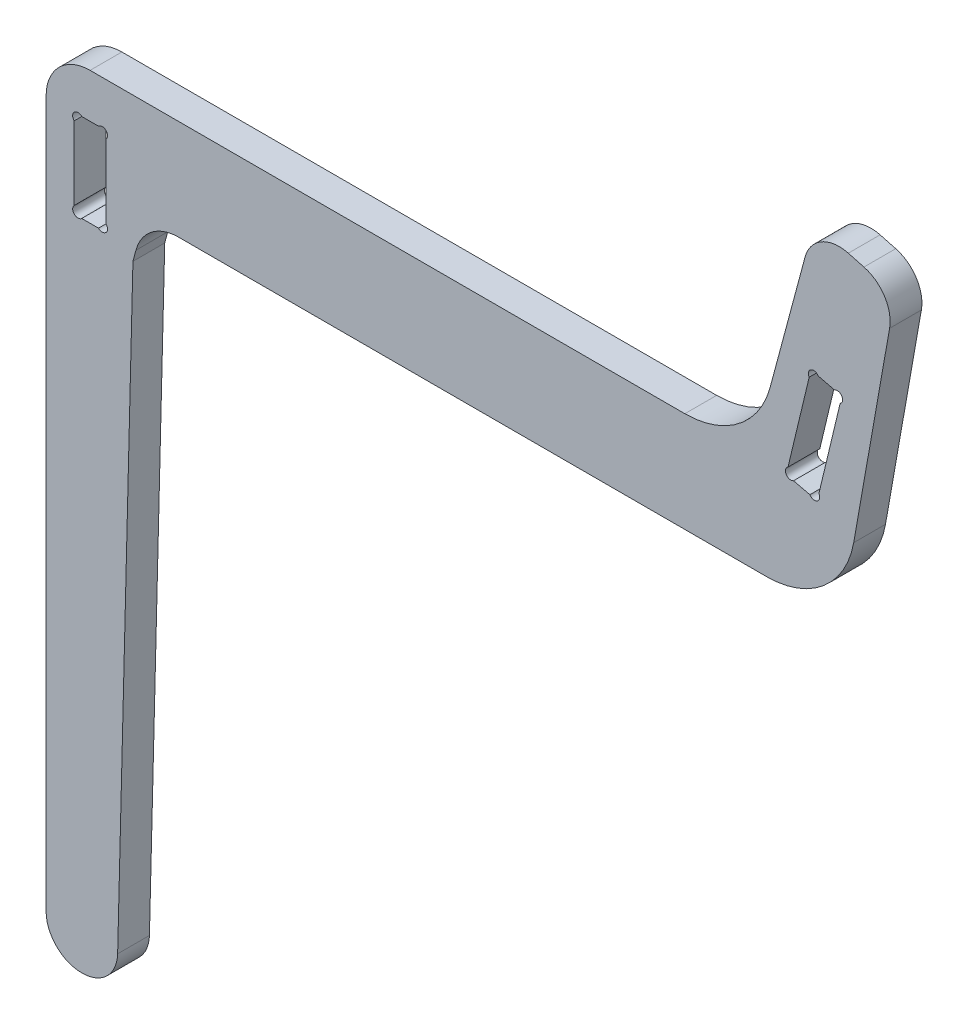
ISO-10303-21;
HEADER;
FILE_DESCRIPTION(('STEP AP214'),'2;1');
FILE_NAME('part.step','',(''),(''),'','','');
FILE_SCHEMA(('AUTOMOTIVE_DESIGN { 1 0 10303 214 1 1 1 1 }'));
ENDSEC;
DATA;
#1=APPLICATION_CONTEXT('core data for automotive mechanical design processes');
#2=APPLICATION_PROTOCOL_DEFINITION('international standard','automotive_design',2000,#1);
#3=PRODUCT_CONTEXT('',#1,'mechanical');
#4=PRODUCT('Part','Part','',(#3));
#5=PRODUCT_RELATED_PRODUCT_CATEGORY('part','',(#4));
#6=PRODUCT_DEFINITION_FORMATION('','',#4);
#7=PRODUCT_DEFINITION_CONTEXT('part definition',#1,'design');
#8=PRODUCT_DEFINITION('design','',#6,#7);
#9=PRODUCT_DEFINITION_SHAPE('','',#8);
#10=(LENGTH_UNIT() NAMED_UNIT(*) SI_UNIT(.MILLI.,.METRE.));
#11=(NAMED_UNIT(*) PLANE_ANGLE_UNIT() SI_UNIT($,.RADIAN.));
#12=(NAMED_UNIT(*) SI_UNIT($,.STERADIAN.) SOLID_ANGLE_UNIT());
#13=UNCERTAINTY_MEASURE_WITH_UNIT(LENGTH_MEASURE(1.E-05),#10,'distance_accuracy_value','');
#14=(GEOMETRIC_REPRESENTATION_CONTEXT(3) GLOBAL_UNCERTAINTY_ASSIGNED_CONTEXT((#13)) GLOBAL_UNIT_ASSIGNED_CONTEXT((#10,
#11,#12)) REPRESENTATION_CONTEXT('',''));
#15=CARTESIAN_POINT('',(0.,0.,0.));
#16=DIRECTION('',(0.,0.,1.));
#17=DIRECTION('',(1.,0.,0.));
#18=AXIS2_PLACEMENT_3D('',#15,#16,#17);
#19=CARTESIAN_POINT('',(74.1732183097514,276.818219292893,18.));
#20=DIRECTION('',(0.258819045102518,0.965925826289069,0.));
#21=DIRECTION('',(-0.965925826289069,0.258819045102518,0.));
#22=AXIS2_PLACEMENT_3D('',#19,#20,#21);
#23=PLANE('',#22);
#24=DIRECTION('',(0.965925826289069,-0.258819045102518,0.));
#25=VECTOR('',#24,1.);
#26=CARTESIAN_POINT('',(74.1732183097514,276.818219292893,0.));
#27=LINE('',#26,#25);
#28=CARTESIAN_POINT('',(454.196815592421,174.991203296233,0.));
#29=VERTEX_POINT('',#28);
#30=CARTESIAN_POINT('',(463.039607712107,172.621784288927,0.));
#31=VERTEX_POINT('',#30);
#32=EDGE_CURVE('E290',#29,#31,#27,.T.);
#33=ORIENTED_EDGE('',*,*,#32,.F.);
#34=DIRECTION('',(0.,0.,-1.));
#35=VECTOR('',#34,1.);
#36=CARTESIAN_POINT('',(454.196815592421,174.991203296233,18.));
#37=LINE('',#36,#35);
#38=CARTESIAN_POINT('',(454.196815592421,174.991203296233,18.));
#39=VERTEX_POINT('',#38);
#40=EDGE_CURVE('E359',#39,#29,#37,.T.);
#41=ORIENTED_EDGE('',*,*,#40,.F.);
#42=DIRECTION('',(0.965925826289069,-0.258819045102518,0.));
#43=VECTOR('',#42,1.);
#44=CARTESIAN_POINT('',(74.1732183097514,276.818219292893,18.));
#45=LINE('',#44,#43);
#46=CARTESIAN_POINT('',(463.039607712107,172.621784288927,18.));
#47=VERTEX_POINT('',#46);
#48=EDGE_CURVE('E473',#39,#47,#45,.T.);
#49=ORIENTED_EDGE('',*,*,#48,.T.);
#50=DIRECTION('',(0.,0.,-1.));
#51=VECTOR('',#50,1.);
#52=CARTESIAN_POINT('',(463.039607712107,172.621784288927,18.));
#53=LINE('',#52,#51);
#54=EDGE_CURVE('E334',#47,#31,#53,.T.);
#55=ORIENTED_EDGE('',*,*,#54,.T.);
#56=EDGE_LOOP('',(#33,#41,#49,#55));
#57=FACE_BOUND('',#56,.T.);
#58=ADVANCED_FACE('F35',(#57),#23,.T.);
#59=CARTESIAN_POINT('',(449.020434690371,155.672686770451,18.));
#60=DIRECTION('',(0.,0.,-1.));
#61=DIRECTION('',(-1.,0.,0.));
#62=AXIS2_PLACEMENT_3D('',#59,#60,#61);
#63=CYLINDRICAL_SURFACE('',#62,20.);
#64=CARTESIAN_POINT('',(449.020434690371,155.672686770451,0.));
#65=DIRECTION('',(0.,0.,1.));
#66=DIRECTION('',(1.,0.,0.));
#67=AXIS2_PLACEMENT_3D('',#64,#65,#66);
#68=CIRCLE('',#67,20.);
#69=CARTESIAN_POINT('',(429.701918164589,160.849067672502,0.));
#70=VERTEX_POINT('',#69);
#71=EDGE_CURVE('E293',#29,#70,#68,.T.);
#72=ORIENTED_EDGE('',*,*,#71,.T.);
#73=DIRECTION('',(0.,0.,-1.));
#74=VECTOR('',#73,1.);
#75=CARTESIAN_POINT('',(429.701918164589,160.849067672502,18.));
#76=LINE('',#75,#74);
#77=CARTESIAN_POINT('',(429.701918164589,160.849067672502,18.));
#78=VERTEX_POINT('',#77);
#79=EDGE_CURVE('E357',#78,#70,#76,.T.);
#80=ORIENTED_EDGE('',*,*,#79,.F.);
#81=CARTESIAN_POINT('',(449.020434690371,155.672686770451,18.));
#82=DIRECTION('',(0.,0.,1.));
#83=DIRECTION('',(1.,0.,0.));
#84=AXIS2_PLACEMENT_3D('',#81,#82,#83);
#85=CIRCLE('',#84,20.);
#86=EDGE_CURVE('E476',#39,#78,#85,.T.);
#87=ORIENTED_EDGE('',*,*,#86,.F.);
#88=ORIENTED_EDGE('',*,*,#40,.T.);
#89=EDGE_LOOP('',(#72,#80,#87,#88));
#90=FACE_BOUND('',#89,.T.);
#91=ADVANCED_FACE('F526',(#90),#63,.T.);
#92=CARTESIAN_POINT('',(360.705080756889,-96.6506350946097,18.));
#93=DIRECTION('',(-0.965925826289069,0.258819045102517,0.));
#94=DIRECTION('',(-0.258819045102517,-0.965925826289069,0.));
#95=AXIS2_PLACEMENT_3D('',#92,#93,#94);
#96=PLANE('',#95);
#97=DIRECTION('',(0.258819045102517,0.965925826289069,0.));
#98=VECTOR('',#97,1.);
#99=CARTESIAN_POINT('',(360.705080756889,-96.6506350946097,0.));
#100=LINE('',#99,#98);
#101=CARTESIAN_POINT('',(409.929941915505,87.0590477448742,0.));
#102=VERTEX_POINT('',#101);
#103=EDGE_CURVE('E296',#102,#70,#100,.T.);
#104=ORIENTED_EDGE('',*,*,#103,.F.);
#105=DIRECTION('',(0.,0.,-1.));
#106=VECTOR('',#105,1.);
#107=CARTESIAN_POINT('',(409.929941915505,87.0590477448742,18.));
#108=LINE('',#107,#106);
#109=CARTESIAN_POINT('',(409.929941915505,87.0590477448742,18.));
#110=VERTEX_POINT('',#109);
#111=EDGE_CURVE('E355',#110,#102,#108,.T.);
#112=ORIENTED_EDGE('',*,*,#111,.F.);
#113=DIRECTION('',(0.258819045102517,0.965925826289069,0.));
#114=VECTOR('',#113,1.);
#115=CARTESIAN_POINT('',(360.705080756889,-96.6506350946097,18.));
#116=LINE('',#115,#114);
#117=EDGE_CURVE('E478',#110,#78,#116,.T.);
#118=ORIENTED_EDGE('',*,*,#117,.T.);
#119=ORIENTED_EDGE('',*,*,#79,.T.);
#120=EDGE_LOOP('',(#104,#112,#118,#119));
#121=FACE_BOUND('',#120,.T.);
#122=ADVANCED_FACE('F529',(#121),#96,.T.);
#123=CARTESIAN_POINT('',(361.633650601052,100.,18.));
#124=DIRECTION('',(0.,0.,-1.));
#125=DIRECTION('',(-1.,0.,0.));
#126=AXIS2_PLACEMENT_3D('',#123,#124,#125);
#127=CYLINDRICAL_SURFACE('',#126,50.);
#128=CARTESIAN_POINT('',(361.633650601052,100.,0.));
#129=DIRECTION('',(0.,0.,1.));
#130=DIRECTION('',(1.,0.,0.));
#131=AXIS2_PLACEMENT_3D('',#128,#129,#130);
#132=CIRCLE('',#131,50.);
#133=CARTESIAN_POINT('',(361.633650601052,50.0000000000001,0.));
#134=VERTEX_POINT('',#133);
#135=EDGE_CURVE('E299',#102,#134,#132,.F.);
#136=ORIENTED_EDGE('',*,*,#135,.T.);
#137=DIRECTION('',(0.,0.,-1.));
#138=VECTOR('',#137,1.);
#139=CARTESIAN_POINT('',(361.633650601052,50.0000000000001,18.));
#140=LINE('',#139,#138);
#141=CARTESIAN_POINT('',(361.633650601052,50.0000000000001,18.));
#142=VERTEX_POINT('',#141);
#143=EDGE_CURVE('E353',#142,#134,#140,.T.);
#144=ORIENTED_EDGE('',*,*,#143,.F.);
#145=CARTESIAN_POINT('',(361.633650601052,100.,18.));
#146=DIRECTION('',(0.,0.,1.));
#147=DIRECTION('',(1.,0.,0.));
#148=AXIS2_PLACEMENT_3D('',#145,#146,#147);
#149=CIRCLE('',#148,50.);
#150=EDGE_CURVE('E481',#110,#142,#149,.F.);
#151=ORIENTED_EDGE('',*,*,#150,.F.);
#152=ORIENTED_EDGE('',*,*,#111,.T.);
#153=EDGE_LOOP('',(#136,#144,#151,#152));
#154=FACE_BOUND('',#153,.T.);
#155=ADVANCED_FACE('F535',(#154),#127,.F.);
#156=CARTESIAN_POINT('',(0.,50.,18.));
#157=DIRECTION('',(0.,1.,0.));
#158=DIRECTION('',(-1.,0.,0.));
#159=AXIS2_PLACEMENT_3D('',#156,#157,#158);
#160=PLANE('',#159);
#161=DIRECTION('',(1.,0.,0.));
#162=VECTOR('',#161,1.);
#163=CARTESIAN_POINT('',(0.,50.,0.));
#164=LINE('',#163,#162);
#165=CARTESIAN_POINT('',(24.9000000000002,50.,0.));
#166=VERTEX_POINT('',#165);
#167=EDGE_CURVE('E302',#166,#134,#164,.T.);
#168=ORIENTED_EDGE('',*,*,#167,.F.);
#169=DIRECTION('',(0.,0.,-1.));
#170=VECTOR('',#169,1.);
#171=CARTESIAN_POINT('',(24.9000000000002,50.,18.));
#172=LINE('',#171,#170);
#173=CARTESIAN_POINT('',(24.9000000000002,50.,18.));
#174=VERTEX_POINT('',#173);
#175=EDGE_CURVE('E351',#174,#166,#172,.T.);
#176=ORIENTED_EDGE('',*,*,#175,.F.);
#177=DIRECTION('',(1.,0.,0.));
#178=VECTOR('',#177,1.);
#179=CARTESIAN_POINT('',(0.,50.,18.));
#180=LINE('',#179,#178);
#181=EDGE_CURVE('E483',#174,#142,#180,.T.);
#182=ORIENTED_EDGE('',*,*,#181,.T.);
#183=ORIENTED_EDGE('',*,*,#143,.T.);
#184=EDGE_LOOP('',(#168,#176,#182,#183));
#185=FACE_BOUND('',#184,.T.);
#186=ADVANCED_FACE('F539',(#185),#160,.T.);
#187=CARTESIAN_POINT('',(24.9,25.1,18.));
#188=DIRECTION('',(0.,0.,-1.));
#189=DIRECTION('',(-1.,0.,0.));
#190=AXIS2_PLACEMENT_3D('',#187,#188,#189);
#191=CYLINDRICAL_SURFACE('',#190,24.9);
#192=CARTESIAN_POINT('',(24.9,25.1,0.));
#193=DIRECTION('',(0.,0.,1.));
#194=DIRECTION('',(1.,0.,0.));
#195=AXIS2_PLACEMENT_3D('',#192,#193,#194);
#196=CIRCLE('',#195,24.9);
#197=CARTESIAN_POINT('',(0.,25.0999999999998,0.));
#198=VERTEX_POINT('',#197);
#199=EDGE_CURVE('E305',#198,#166,#196,.F.);
#200=ORIENTED_EDGE('',*,*,#199,.F.);
#201=DIRECTION('',(0.,0.,-1.));
#202=VECTOR('',#201,1.);
#203=CARTESIAN_POINT('',(0.,25.0999999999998,18.));
#204=LINE('',#203,#202);
#205=CARTESIAN_POINT('',(0.,25.0999999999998,18.));
#206=VERTEX_POINT('',#205);
#207=EDGE_CURVE('E348',#206,#198,#204,.T.);
#208=ORIENTED_EDGE('',*,*,#207,.F.);
#209=CARTESIAN_POINT('',(24.9,25.1,18.));
#210=DIRECTION('',(0.,0.,1.));
#211=DIRECTION('',(1.,0.,0.));
#212=AXIS2_PLACEMENT_3D('',#209,#210,#211);
#213=CIRCLE('',#212,24.9);
#214=EDGE_CURVE('E486',#206,#174,#213,.F.);
#215=ORIENTED_EDGE('',*,*,#214,.T.);
#216=ORIENTED_EDGE('',*,*,#175,.T.);
#217=EDGE_LOOP('',(#200,#208,#215,#216));
#218=FACE_BOUND('',#217,.T.);
#219=ADVANCED_FACE('F542',(#218),#191,.T.);
#220=CARTESIAN_POINT('',(0.,0.,18.));
#221=DIRECTION('',(-1.,0.,0.));
#222=DIRECTION('',(0.,0.,1.));
#223=AXIS2_PLACEMENT_3D('',#220,#221,#222);
#224=PLANE('',#223);
#225=DIRECTION('',(0.,1.,0.));
#226=VECTOR('',#225,1.);
#227=CARTESIAN_POINT('',(0.,0.,0.));
#228=LINE('',#227,#226);
#229=CARTESIAN_POINT('',(0.,-374.9,0.));
#230=VERTEX_POINT('',#229);
#231=EDGE_CURVE('E308',#230,#198,#228,.T.);
#232=ORIENTED_EDGE('',*,*,#231,.F.);
#233=DIRECTION('',(0.,0.,-1.));
#234=VECTOR('',#233,1.);
#235=CARTESIAN_POINT('',(0.,-374.9,18.));
#236=LINE('',#235,#234);
#237=CARTESIAN_POINT('',(0.,-374.9,18.));
#238=VERTEX_POINT('',#237);
#239=EDGE_CURVE('E370',#230,#238,#236,.F.);
#240=ORIENTED_EDGE('',*,*,#239,.T.);
#241=DIRECTION('',(0.,1.,0.));
#242=VECTOR('',#241,1.);
#243=CARTESIAN_POINT('',(0.,0.,18.));
#244=LINE('',#243,#242);
#245=EDGE_CURVE('E489',#238,#206,#244,.T.);
#246=ORIENTED_EDGE('',*,*,#245,.T.);
#247=ORIENTED_EDGE('',*,*,#207,.T.);
#248=EDGE_LOOP('',(#232,#240,#246,#247));
#249=FACE_BOUND('',#248,.T.);
#250=ADVANCED_FACE('F583',(#249),#224,.T.);
#251=CARTESIAN_POINT('',(0.,-394.9,18.));
#252=DIRECTION('',(0.,1.,0.));
#253=DIRECTION('',(0.,0.,1.));
#254=AXIS2_PLACEMENT_3D('',#251,#252,#253);
#255=PLANE('',#254);
#256=DIRECTION('',(1.,0.,0.));
#257=VECTOR('',#256,1.);
#258=CARTESIAN_POINT('',(0.,-394.9,18.));
#259=LINE('',#258,#257);
#260=CARTESIAN_POINT('',(20.,-394.9,18.));
#261=VERTEX_POINT('',#260);
#262=CARTESIAN_POINT('',(20.4974080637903,-394.9,18.));
#263=VERTEX_POINT('',#262);
#264=EDGE_CURVE('E491',#261,#263,#259,.T.);
#265=ORIENTED_EDGE('',*,*,#264,.F.);
#266=DIRECTION('',(0.,0.,-1.));
#267=VECTOR('',#266,1.);
#268=CARTESIAN_POINT('',(20.,-394.9,0.));
#269=LINE('',#268,#267);
#270=CARTESIAN_POINT('',(20.,-394.9,0.));
#271=VERTEX_POINT('',#270);
#272=EDGE_CURVE('E363',#261,#271,#269,.T.);
#273=ORIENTED_EDGE('',*,*,#272,.T.);
#274=DIRECTION('',(1.,0.,0.));
#275=VECTOR('',#274,1.);
#276=CARTESIAN_POINT('',(0.,-394.9,0.));
#277=LINE('',#276,#275);
#278=CARTESIAN_POINT('',(20.4974080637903,-394.9,0.));
#279=VERTEX_POINT('',#278);
#280=EDGE_CURVE('E310',#271,#279,#277,.T.);
#281=ORIENTED_EDGE('',*,*,#280,.T.);
#282=DIRECTION('',(0.,0.,-1.));
#283=VECTOR('',#282,1.);
#284=CARTESIAN_POINT('',(20.4974080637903,-394.9,18.));
#285=LINE('',#284,#283);
#286=EDGE_CURVE('E361',#279,#263,#285,.F.);
#287=ORIENTED_EDGE('',*,*,#286,.T.);
#288=EDGE_LOOP('',(#265,#273,#281,#287));
#289=FACE_BOUND('',#288,.T.);
#290=ADVANCED_FACE('F553',(#289),#255,.F.);
#291=CARTESIAN_POINT('',(49.914900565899,-1.25723452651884,18.));
#292=DIRECTION('',(0.999682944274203,-0.0251795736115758,0.));
#293=DIRECTION('',(0.0251795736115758,0.999682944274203,0.));
#294=AXIS2_PLACEMENT_3D('',#291,#292,#293);
#295=PLANE('',#294);
#296=DIRECTION('',(-0.0251795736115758,-0.999682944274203,0.));
#297=VECTOR('',#296,1.);
#298=CARTESIAN_POINT('',(49.914900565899,-1.25723452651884,18.));
#299=LINE('',#298,#297);
#300=CARTESIAN_POINT('',(49.1520859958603,-31.5426050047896,18.));
#301=VERTEX_POINT('',#300);
#302=CARTESIAN_POINT('',(40.4910669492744,-375.403591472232,18.));
#303=VERTEX_POINT('',#302);
#304=EDGE_CURVE('E494',#301,#303,#299,.T.);
#305=ORIENTED_EDGE('',*,*,#304,.T.);
#306=DIRECTION('',(0.,0.,-1.));
#307=VECTOR('',#306,1.);
#308=CARTESIAN_POINT('',(40.4910669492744,-375.403591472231,0.));
#309=LINE('',#308,#307);
#310=CARTESIAN_POINT('',(40.4910669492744,-375.403591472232,0.));
#311=VERTEX_POINT('',#310);
#312=EDGE_CURVE('E376',#303,#311,#309,.T.);
#313=ORIENTED_EDGE('',*,*,#312,.T.);
#314=DIRECTION('',(-0.0251795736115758,-0.999682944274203,0.));
#315=VECTOR('',#314,1.);
#316=CARTESIAN_POINT('',(49.914900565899,-1.25723452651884,0.));
#317=LINE('',#316,#315);
#318=CARTESIAN_POINT('',(49.1520859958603,-31.5426050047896,0.));
#319=VERTEX_POINT('',#318);
#320=EDGE_CURVE('E313',#319,#311,#317,.T.);
#321=ORIENTED_EDGE('',*,*,#320,.F.);
#322=DIRECTION('',(0.,0.,-1.));
#323=VECTOR('',#322,1.);
#324=CARTESIAN_POINT('',(49.1520859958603,-31.5426050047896,18.));
#325=LINE('',#324,#323);
#326=EDGE_CURVE('E346',#301,#319,#325,.T.);
#327=ORIENTED_EDGE('',*,*,#326,.F.);
#328=EDGE_LOOP('',(#305,#313,#321,#327));
#329=FACE_BOUND('',#328,.T.);
#330=ADVANCED_FACE('F562',(#329),#295,.T.);
#331=CARTESIAN_POINT('',(53.744944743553,-14.3961505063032,18.));
#332=DIRECTION('',(-0.965947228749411,0.258739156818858,0.));
#333=DIRECTION('',(-0.258739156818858,-0.965947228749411,0.));
#334=AXIS2_PLACEMENT_3D('',#331,#332,#333);
#335=PLANE('',#334);
#336=DIRECTION('',(0.258739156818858,0.965947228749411,0.));
#337=VECTOR('',#336,1.);
#338=CARTESIAN_POINT('',(53.744944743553,-14.3961505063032,0.));
#339=LINE('',#338,#337);
#340=CARTESIAN_POINT('',(50.8479140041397,-25.2115943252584,0.));
#341=VERTEX_POINT('',#340);
#342=EDGE_CURVE('E316',#319,#341,#339,.T.);
#343=ORIENTED_EDGE('',*,*,#342,.T.);
#344=DIRECTION('',(0.,0.,-1.));
#345=VECTOR('',#344,1.);
#346=CARTESIAN_POINT('',(50.8479140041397,-25.2115943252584,18.));
#347=LINE('',#346,#345);
#348=CARTESIAN_POINT('',(50.8479140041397,-25.2115943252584,18.));
#349=VERTEX_POINT('',#348);
#350=EDGE_CURVE('E344',#349,#341,#347,.T.);
#351=ORIENTED_EDGE('',*,*,#350,.F.);
#352=DIRECTION('',(0.258739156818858,0.965947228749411,0.));
#353=VECTOR('',#352,1.);
#354=CARTESIAN_POINT('',(53.744944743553,-14.3961505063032,18.));
#355=LINE('',#354,#353);
#356=EDGE_CURVE('E497',#301,#349,#355,.T.);
#357=ORIENTED_EDGE('',*,*,#356,.F.);
#358=ORIENTED_EDGE('',*,*,#326,.T.);
#359=EDGE_LOOP('',(#343,#351,#357,#358));
#360=FACE_BOUND('',#359,.T.);
#361=ADVANCED_FACE('F568',(#360),#335,.F.);
#362=CARTESIAN_POINT('',(74.9,-31.654199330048,18.));
#363=DIRECTION('',(0.,0.,-1.));
#364=DIRECTION('',(-1.,0.,0.));
#365=AXIS2_PLACEMENT_3D('',#362,#363,#364);
#366=CYLINDRICAL_SURFACE('',#365,24.9);
#367=CARTESIAN_POINT('',(74.9,-31.654199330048,0.));
#368=DIRECTION('',(0.,0.,1.));
#369=DIRECTION('',(1.,0.,0.));
#370=AXIS2_PLACEMENT_3D('',#367,#368,#369);
#371=CIRCLE('',#370,24.9);
#372=CARTESIAN_POINT('',(74.9,-6.75419933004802,0.));
#373=VERTEX_POINT('',#372);
#374=EDGE_CURVE('E319',#373,#341,#371,.T.);
#375=ORIENTED_EDGE('',*,*,#374,.F.);
#376=DIRECTION('',(0.,0.,-1.));
#377=VECTOR('',#376,1.);
#378=CARTESIAN_POINT('',(74.9,-6.75419933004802,18.));
#379=LINE('',#378,#377);
#380=CARTESIAN_POINT('',(74.9,-6.75419933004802,18.));
#381=VERTEX_POINT('',#380);
#382=EDGE_CURVE('E342',#381,#373,#379,.T.);
#383=ORIENTED_EDGE('',*,*,#382,.F.);
#384=CARTESIAN_POINT('',(74.9,-31.654199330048,18.));
#385=DIRECTION('',(0.,0.,1.));
#386=DIRECTION('',(1.,0.,0.));
#387=AXIS2_PLACEMENT_3D('',#384,#385,#386);
#388=CIRCLE('',#387,24.9);
#389=EDGE_CURVE('E499',#381,#349,#388,.T.);
#390=ORIENTED_EDGE('',*,*,#389,.T.);
#391=ORIENTED_EDGE('',*,*,#350,.T.);
#392=EDGE_LOOP('',(#375,#383,#390,#391));
#393=FACE_BOUND('',#392,.T.);
#394=ADVANCED_FACE('F571',(#393),#366,.F.);
#395=CARTESIAN_POINT('',(0.,-6.75419933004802,18.));
#396=DIRECTION('',(0.,1.,0.));
#397=DIRECTION('',(0.,0.,1.));
#398=AXIS2_PLACEMENT_3D('',#395,#396,#397);
#399=PLANE('',#398);
#400=DIRECTION('',(1.,0.,0.));
#401=VECTOR('',#400,1.);
#402=CARTESIAN_POINT('',(0.,-6.75419933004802,0.));
#403=LINE('',#402,#401);
#404=CARTESIAN_POINT('',(407.99432757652,-6.75419933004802,0.));
#405=VERTEX_POINT('',#404);
#406=EDGE_CURVE('E322',#373,#405,#403,.T.);
#407=ORIENTED_EDGE('',*,*,#406,.T.);
#408=DIRECTION('',(0.,0.,-1.));
#409=VECTOR('',#408,1.);
#410=CARTESIAN_POINT('',(407.99432757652,-6.75419933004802,18.));
#411=LINE('',#410,#409);
#412=CARTESIAN_POINT('',(407.99432757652,-6.75419933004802,18.));
#413=VERTEX_POINT('',#412);
#414=EDGE_CURVE('E340',#413,#405,#411,.T.);
#415=ORIENTED_EDGE('',*,*,#414,.F.);
#416=DIRECTION('',(1.,0.,0.));
#417=VECTOR('',#416,1.);
#418=CARTESIAN_POINT('',(0.,-6.75419933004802,18.));
#419=LINE('',#418,#417);
#420=EDGE_CURVE('E502',#381,#413,#419,.T.);
#421=ORIENTED_EDGE('',*,*,#420,.F.);
#422=ORIENTED_EDGE('',*,*,#382,.T.);
#423=EDGE_LOOP('',(#407,#415,#421,#422));
#424=FACE_BOUND('',#423,.T.);
#425=ADVANCED_FACE('F576',(#424),#399,.F.);
#426=CARTESIAN_POINT('',(407.99432757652,43.245800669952,18.));
#427=DIRECTION('',(0.,0.,-1.));
#428=DIRECTION('',(-1.,0.,0.));
#429=AXIS2_PLACEMENT_3D('',#426,#427,#428);
#430=CYLINDRICAL_SURFACE('',#429,50.);
#431=CARTESIAN_POINT('',(407.99432757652,43.245800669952,0.));
#432=DIRECTION('',(0.,0.,1.));
#433=DIRECTION('',(1.,0.,0.));
#434=AXIS2_PLACEMENT_3D('',#431,#432,#433);
#435=CIRCLE('',#434,50.);
#436=CARTESIAN_POINT('',(457.234715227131,34.5633917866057,0.));
#437=VERTEX_POINT('',#436);
#438=EDGE_CURVE('E325',#437,#405,#435,.F.);
#439=ORIENTED_EDGE('',*,*,#438,.F.);
#440=DIRECTION('',(0.,0.,-1.));
#441=VECTOR('',#440,1.);
#442=CARTESIAN_POINT('',(457.234715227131,34.5633917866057,18.));
#443=LINE('',#442,#441);
#444=CARTESIAN_POINT('',(457.234715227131,34.5633917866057,18.));
#445=VERTEX_POINT('',#444);
#446=EDGE_CURVE('E338',#445,#437,#443,.T.);
#447=ORIENTED_EDGE('',*,*,#446,.F.);
#448=CARTESIAN_POINT('',(407.99432757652,43.245800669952,18.));
#449=DIRECTION('',(0.,0.,1.));
#450=DIRECTION('',(1.,0.,0.));
#451=AXIS2_PLACEMENT_3D('',#448,#449,#450);
#452=CIRCLE('',#451,50.);
#453=EDGE_CURVE('E504',#445,#413,#452,.F.);
#454=ORIENTED_EDGE('',*,*,#453,.T.);
#455=ORIENTED_EDGE('',*,*,#414,.T.);
#456=EDGE_LOOP('',(#439,#447,#454,#455));
#457=FACE_BOUND('',#456,.T.);
#458=ADVANCED_FACE('F579',(#457),#430,.T.);
#459=CARTESIAN_POINT('',(437.536713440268,-77.1495276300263,18.));
#460=DIRECTION('',(-0.984807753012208,0.173648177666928,0.));
#461=DIRECTION('',(-0.173648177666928,-0.984807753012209,0.));
#462=AXIS2_PLACEMENT_3D('',#459,#460,#461);
#463=PLANE('',#462);
#464=DIRECTION('',(0.173648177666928,0.984807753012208,0.));
#465=VECTOR('',#464,1.);
#466=CARTESIAN_POINT('',(437.536713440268,-77.1495276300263,0.));
#467=LINE('',#466,#465);
#468=CARTESIAN_POINT('',(477.559381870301,149.830304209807,0.));
#469=VERTEX_POINT('',#468);
#470=EDGE_CURVE('E328',#437,#469,#467,.T.);
#471=ORIENTED_EDGE('',*,*,#470,.T.);
#472=DIRECTION('',(0.,0.,-1.));
#473=VECTOR('',#472,1.);
#474=CARTESIAN_POINT('',(477.559381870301,149.830304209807,18.));
#475=LINE('',#474,#473);
#476=CARTESIAN_POINT('',(477.559381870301,149.830304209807,18.));
#477=VERTEX_POINT('',#476);
#478=EDGE_CURVE('E336',#477,#469,#475,.T.);
#479=ORIENTED_EDGE('',*,*,#478,.F.);
#480=DIRECTION('',(0.173648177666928,0.984807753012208,0.));
#481=VECTOR('',#480,1.);
#482=CARTESIAN_POINT('',(437.536713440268,-77.1495276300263,18.));
#483=LINE('',#482,#481);
#484=EDGE_CURVE('E506',#445,#477,#483,.T.);
#485=ORIENTED_EDGE('',*,*,#484,.F.);
#486=ORIENTED_EDGE('',*,*,#446,.T.);
#487=EDGE_LOOP('',(#471,#479,#485,#486));
#488=FACE_BOUND('',#487,.T.);
#489=ADVANCED_FACE('F582',(#488),#463,.F.);
#490=CARTESIAN_POINT('',(47.7796437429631,199.504277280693,18.));
#491=DIRECTION('',(0.232905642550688,0.97249933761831,0.));
#492=DIRECTION('',(-0.97249933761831,0.232905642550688,0.));
#493=AXIS2_PLACEMENT_3D('',#490,#491,#492);
#494=PLANE('',#493);
#495=DIRECTION('',(0.97249933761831,-0.232905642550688,0.));
#496=VECTOR('',#495,1.);
#497=CARTESIAN_POINT('',(47.7796437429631,199.504277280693,0.));
#498=LINE('',#497,#496);
#499=CARTESIAN_POINT('',(437.152341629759,106.252698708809,0.));
#500=VERTEX_POINT('',#499);
#501=CARTESIAN_POINT('',(446.405399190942,104.036667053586,0.));
#502=VERTEX_POINT('',#501);
#503=EDGE_CURVE('E265',#500,#502,#498,.T.);
#504=ORIENTED_EDGE('',*,*,#503,.T.);
#505=DIRECTION('',(0.,0.,1.));
#506=VECTOR('',#505,1.);
#507=CARTESIAN_POINT('',(446.405399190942,104.036667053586,0.));
#508=LINE('',#507,#506);
#509=CARTESIAN_POINT('',(446.405399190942,104.036667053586,18.));
#510=VERTEX_POINT('',#509);
#511=EDGE_CURVE('E401',#502,#510,#508,.T.);
#512=ORIENTED_EDGE('',*,*,#511,.T.);
#513=DIRECTION('',(0.97249933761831,-0.232905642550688,0.));
#514=VECTOR('',#513,1.);
#515=CARTESIAN_POINT('',(47.7796437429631,199.504277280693,18.));
#516=LINE('',#515,#514);
#517=CARTESIAN_POINT('',(437.152341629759,106.252698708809,18.));
#518=VERTEX_POINT('',#517);
#519=EDGE_CURVE('E267',#518,#510,#516,.T.);
#520=ORIENTED_EDGE('',*,*,#519,.F.);
#521=DIRECTION('',(0.,0.,1.));
#522=VECTOR('',#521,1.);
#523=CARTESIAN_POINT('',(437.152341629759,106.252698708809,0.));
#524=LINE('',#523,#522);
#525=EDGE_CURVE('E251',#518,#500,#524,.F.);
#526=ORIENTED_EDGE('',*,*,#525,.T.);
#527=EDGE_LOOP('',(#504,#512,#520,#526));
#528=FACE_BOUND('',#527,.T.);
#529=ADVANCED_FACE('F263',(#528),#494,.F.);
#530=CARTESIAN_POINT('',(402.751720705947,-96.4557451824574,18.));
#531=DIRECTION('',(0.972499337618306,-0.232905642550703,0.));
#532=DIRECTION('',(0.232905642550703,0.972499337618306,0.));
#533=AXIS2_PLACEMENT_3D('',#530,#531,#532);
#534=PLANE('',#533);
#535=DIRECTION('',(-0.232905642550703,-0.972499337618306,0.));
#536=VECTOR('',#535,1.);
#537=CARTESIAN_POINT('',(402.751720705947,-96.4557451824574,0.));
#538=LINE('',#537,#536);
#539=CARTESIAN_POINT('',(449.543229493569,98.9225668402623,0.));
#540=VERTEX_POINT('',#539);
#541=CARTESIAN_POINT('',(437.545160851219,48.8245370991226,0.));
#542=VERTEX_POINT('',#541);
#543=EDGE_CURVE('E274',#540,#542,#538,.T.);
#544=ORIENTED_EDGE('',*,*,#543,.T.);
#545=DIRECTION('',(0.,0.,1.));
#546=VECTOR('',#545,1.);
#547=CARTESIAN_POINT('',(437.545160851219,48.8245370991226,0.));
#548=LINE('',#547,#546);
#549=CARTESIAN_POINT('',(437.545160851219,48.8245370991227,18.));
#550=VERTEX_POINT('',#549);
#551=EDGE_CURVE('E50',#542,#550,#548,.T.);
#552=ORIENTED_EDGE('',*,*,#551,.T.);
#553=DIRECTION('',(-0.232905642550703,-0.972499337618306,0.));
#554=VECTOR('',#553,1.);
#555=CARTESIAN_POINT('',(402.751720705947,-96.4557451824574,18.));
#556=LINE('',#555,#554);
#557=CARTESIAN_POINT('',(449.543229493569,98.9225668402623,18.));
#558=VERTEX_POINT('',#557);
#559=EDGE_CURVE('E399',#558,#550,#556,.T.);
#560=ORIENTED_EDGE('',*,*,#559,.F.);
#561=DIRECTION('',(0.,0.,1.));
#562=VECTOR('',#561,1.);
#563=CARTESIAN_POINT('',(449.543229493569,98.9225668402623,0.));
#564=LINE('',#563,#562);
#565=EDGE_CURVE('E268',#558,#540,#564,.F.);
#566=ORIENTED_EDGE('',*,*,#565,.T.);
#567=EDGE_LOOP('',(#544,#552,#560,#566));
#568=FACE_BOUND('',#567,.T.);
#569=ADVANCED_FACE('F395',(#568),#534,.F.);
#570=CARTESIAN_POINT('',(33.8053051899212,141.154317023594,18.));
#571=DIRECTION('',(0.232905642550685,0.97249933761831,0.));
#572=DIRECTION('',(-0.972499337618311,0.232905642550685,0.));
#573=AXIS2_PLACEMENT_3D('',#570,#571,#572);
#574=PLANE('',#573);
#575=DIRECTION('',(0.,0.,1.));
#576=VECTOR('',#575,1.);
#577=CARTESIAN_POINT('',(423.178003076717,47.902738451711,0.));
#578=LINE('',#577,#576);
#579=CARTESIAN_POINT('',(423.178003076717,47.902738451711,18.));
#580=VERTEX_POINT('',#579);
#581=CARTESIAN_POINT('',(423.178003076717,47.902738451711,0.));
#582=VERTEX_POINT('',#581);
#583=EDGE_CURVE('E412',#580,#582,#578,.F.);
#584=ORIENTED_EDGE('',*,*,#583,.F.);
#585=DIRECTION('',(0.972499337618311,-0.232905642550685,0.));
#586=VECTOR('',#585,1.);
#587=CARTESIAN_POINT('',(33.8053051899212,141.154317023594,18.));
#588=LINE('',#587,#586);
#589=CARTESIAN_POINT('',(432.4310606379,45.6867067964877,18.));
#590=VERTEX_POINT('',#589);
#591=EDGE_CURVE('E467',#580,#590,#588,.T.);
#592=ORIENTED_EDGE('',*,*,#591,.T.);
#593=DIRECTION('',(0.,0.,1.));
#594=VECTOR('',#593,1.);
#595=CARTESIAN_POINT('',(432.4310606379,45.6867067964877,0.));
#596=LINE('',#595,#594);
#597=CARTESIAN_POINT('',(432.4310606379,45.6867067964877,0.));
#598=VERTEX_POINT('',#597);
#599=EDGE_CURVE('E403',#598,#590,#596,.T.);
#600=ORIENTED_EDGE('',*,*,#599,.F.);
#601=DIRECTION('',(0.972499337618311,-0.232905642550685,0.));
#602=VECTOR('',#601,1.);
#603=CARTESIAN_POINT('',(33.8053051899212,141.154317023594,0.));
#604=LINE('',#603,#602);
#605=EDGE_CURVE('E278',#582,#598,#604,.T.);
#606=ORIENTED_EDGE('',*,*,#605,.F.);
#607=EDGE_LOOP('',(#584,#592,#600,#606));
#608=FACE_BOUND('',#607,.T.);
#609=ADVANCED_FACE('F603',(#608),#574,.T.);
#610=CARTESIAN_POINT('',(385.246732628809,-92.2634436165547,18.));
#611=DIRECTION('',(0.972499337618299,-0.232905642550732,0.));
#612=DIRECTION('',(0.232905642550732,0.972499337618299,0.));
#613=AXIS2_PLACEMENT_3D('',#610,#611,#612);
#614=PLANE('',#613);
#615=DIRECTION('',(0.,0.,1.));
#616=VECTOR('',#615,1.);
#617=CARTESIAN_POINT('',(420.040172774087,53.0168386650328,0.));
#618=LINE('',#617,#616);
#619=CARTESIAN_POINT('',(420.040172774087,53.0168386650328,0.));
#620=VERTEX_POINT('',#619);
#621=CARTESIAN_POINT('',(420.040172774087,53.0168386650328,18.));
#622=VERTEX_POINT('',#621);
#623=EDGE_CURVE('E409',#620,#622,#618,.T.);
#624=ORIENTED_EDGE('',*,*,#623,.F.);
#625=DIRECTION('',(-0.232905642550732,-0.972499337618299,0.));
#626=VECTOR('',#625,1.);
#627=CARTESIAN_POINT('',(385.246732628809,-92.2634436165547,0.));
#628=LINE('',#627,#626);
#629=CARTESIAN_POINT('',(432.038241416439,103.114868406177,0.));
#630=VERTEX_POINT('',#629);
#631=EDGE_CURVE('E288',#630,#620,#628,.T.);
#632=ORIENTED_EDGE('',*,*,#631,.F.);
#633=DIRECTION('',(0.,0.,1.));
#634=VECTOR('',#633,1.);
#635=CARTESIAN_POINT('',(432.038241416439,103.114868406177,0.));
#636=LINE('',#635,#634);
#637=CARTESIAN_POINT('',(432.038241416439,103.114868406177,18.));
#638=VERTEX_POINT('',#637);
#639=EDGE_CURVE('E254',#638,#630,#636,.F.);
#640=ORIENTED_EDGE('',*,*,#639,.F.);
#641=DIRECTION('',(-0.232905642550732,-0.972499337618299,0.));
#642=VECTOR('',#641,1.);
#643=CARTESIAN_POINT('',(385.246732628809,-92.2634436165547,18.));
#644=LINE('',#643,#642);
#645=EDGE_CURVE('E470',#638,#622,#644,.T.);
#646=ORIENTED_EDGE('',*,*,#645,.T.);
#647=EDGE_LOOP('',(#624,#632,#640,#646));
#648=FACE_BOUND('',#647,.T.);
#649=ADVANCED_FACE('F600',(#648),#614,.T.);
#650=CARTESIAN_POINT('',(457.863226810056,153.303267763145,18.));
#651=DIRECTION('',(0.,0.,-1.));
#652=DIRECTION('',(-1.,0.,0.));
#653=AXIS2_PLACEMENT_3D('',#650,#651,#652);
#654=CYLINDRICAL_SURFACE('',#653,20.);
#655=CARTESIAN_POINT('',(457.863226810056,153.303267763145,0.));
#656=DIRECTION('',(0.,0.,1.));
#657=DIRECTION('',(1.,0.,0.));
#658=AXIS2_PLACEMENT_3D('',#655,#656,#657);
#659=CIRCLE('',#658,20.);
#660=EDGE_CURVE('E331',#31,#469,#659,.F.);
#661=ORIENTED_EDGE('',*,*,#660,.F.);
#662=ORIENTED_EDGE('',*,*,#54,.F.);
#663=CARTESIAN_POINT('',(457.863226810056,153.303267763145,18.));
#664=DIRECTION('',(0.,0.,1.));
#665=DIRECTION('',(1.,0.,0.));
#666=AXIS2_PLACEMENT_3D('',#663,#664,#665);
#667=CIRCLE('',#666,20.);
#668=EDGE_CURVE('E284',#47,#477,#667,.F.);
#669=ORIENTED_EDGE('',*,*,#668,.T.);
#670=ORIENTED_EDGE('',*,*,#478,.T.);
#671=EDGE_LOOP('',(#661,#662,#669,#670));
#672=FACE_BOUND('',#671,.T.);
#673=ADVANCED_FACE('F515',(#672),#654,.T.);
#674=CARTESIAN_POINT('',(0.,0.,18.));
#675=DIRECTION('',(0.,0.,1.));
#676=DIRECTION('',(1.,0.,0.));
#677=AXIS2_PLACEMENT_3D('',#674,#675,#676);
#678=PLANE('',#677);
#679=CARTESIAN_POINT('',(421.609087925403,50.4597885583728,18.));
#680=DIRECTION('',(0.,0.,1.));
#681=DIRECTION('',(-1.,0.,0.));
#682=AXIS2_PLACEMENT_3D('',#679,#680,#681);
#683=CIRCLE('',#682,3.);
#684=EDGE_CURVE('E826',#622,#580,#683,.T.);
#685=ORIENTED_EDGE('',*,*,#684,.F.);
#686=ORIENTED_EDGE('',*,*,#645,.F.);
#687=CARTESIAN_POINT('',(434.595291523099,104.683783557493,18.));
#688=DIRECTION('',(0.,0.,1.));
#689=DIRECTION('',(1.,0.,0.));
#690=AXIS2_PLACEMENT_3D('',#687,#688,#689);
#691=CIRCLE('',#690,2.99999999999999);
#692=EDGE_CURVE('E831',#518,#638,#691,.T.);
#693=ORIENTED_EDGE('',*,*,#692,.F.);
#694=ORIENTED_EDGE('',*,*,#519,.T.);
#695=CARTESIAN_POINT('',(447.974314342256,101.479616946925,18.));
#696=DIRECTION('',(0.,0.,1.));
#697=DIRECTION('',(-1.,0.,0.));
#698=AXIS2_PLACEMENT_3D('',#695,#696,#697);
#699=CIRCLE('',#698,2.99999999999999);
#700=EDGE_CURVE('E829',#558,#510,#699,.T.);
#701=ORIENTED_EDGE('',*,*,#700,.F.);
#702=ORIENTED_EDGE('',*,*,#559,.T.);
#703=CARTESIAN_POINT('',(434.988110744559,47.2556219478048,18.));
#704=DIRECTION('',(0.,0.,1.));
#705=DIRECTION('',(1.,0.,0.));
#706=AXIS2_PLACEMENT_3D('',#703,#704,#705);
#707=CIRCLE('',#706,2.99999999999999);
#708=EDGE_CURVE('E828',#590,#550,#707,.T.);
#709=ORIENTED_EDGE('',*,*,#708,.F.);
#710=ORIENTED_EDGE('',*,*,#591,.F.);
#711=EDGE_LOOP('',(#685,#686,#693,#694,#701,#702,#709,#710));
#712=FACE_BOUND('',#711,.T.);
#713=CARTESIAN_POINT('',(18.0213203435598,-22.8786796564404,18.));
#714=DIRECTION('',(0.,0.,1.));
#715=DIRECTION('',(-1.,0.,0.));
#716=AXIS2_PLACEMENT_3D('',#713,#714,#715);
#717=CIRCLE('',#716,3.);
#718=CARTESIAN_POINT('',(15.9000000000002,-20.7573593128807,18.));
#719=VERTEX_POINT('',#718);
#720=CARTESIAN_POINT('',(20.1426406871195,-25.,18.));
#721=VERTEX_POINT('',#720);
#722=EDGE_CURVE('E414',#719,#721,#717,.T.);
#723=ORIENTED_EDGE('',*,*,#722,.F.);
#724=DIRECTION('',(0.,-1.,0.));
#725=VECTOR('',#724,1.);
#726=CARTESIAN_POINT('',(15.9000000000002,-25.,18.));
#727=LINE('',#726,#725);
#728=CARTESIAN_POINT('',(15.9000000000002,20.7573593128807,18.));
#729=VERTEX_POINT('',#728);
#730=EDGE_CURVE('E460',#729,#719,#727,.T.);
#731=ORIENTED_EDGE('',*,*,#730,.F.);
#732=CARTESIAN_POINT('',(18.0213203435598,22.8786796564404,18.));
#733=DIRECTION('',(0.,0.,1.));
#734=DIRECTION('',(1.,0.,0.));
#735=AXIS2_PLACEMENT_3D('',#732,#733,#734);
#736=CIRCLE('',#735,3.);
#737=CARTESIAN_POINT('',(20.1426406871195,25.,18.));
#738=VERTEX_POINT('',#737);
#739=EDGE_CURVE('E417',#738,#729,#736,.T.);
#740=ORIENTED_EDGE('',*,*,#739,.F.);
#741=DIRECTION('',(-1.,0.,0.));
#742=VECTOR('',#741,1.);
#743=CARTESIAN_POINT('',(15.9000000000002,25.,18.));
#744=LINE('',#743,#742);
#745=CARTESIAN_POINT('',(29.6573593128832,25.,18.));
#746=VERTEX_POINT('',#745);
#747=EDGE_CURVE('E457',#746,#738,#744,.T.);
#748=ORIENTED_EDGE('',*,*,#747,.F.);
#749=CARTESIAN_POINT('',(31.7786796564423,22.8786796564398,18.));
#750=DIRECTION('',(0.,0.,1.));
#751=DIRECTION('',(-1.,0.,0.));
#752=AXIS2_PLACEMENT_3D('',#749,#750,#751);
#753=CIRCLE('',#752,3.);
#754=CARTESIAN_POINT('',(33.9000000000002,20.7573593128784,18.));
#755=VERTEX_POINT('',#754);
#756=EDGE_CURVE('E418',#755,#746,#753,.T.);
#757=ORIENTED_EDGE('',*,*,#756,.F.);
#758=DIRECTION('',(0.,1.,0.));
#759=VECTOR('',#758,1.);
#760=CARTESIAN_POINT('',(33.9000000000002,-25.,18.));
#761=LINE('',#760,#759);
#762=CARTESIAN_POINT('',(33.9000000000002,-20.7573593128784,18.));
#763=VERTEX_POINT('',#762);
#764=EDGE_CURVE('E445',#763,#755,#761,.T.);
#765=ORIENTED_EDGE('',*,*,#764,.F.);
#766=CARTESIAN_POINT('',(31.7786796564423,-22.8786796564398,18.));
#767=DIRECTION('',(0.,0.,1.));
#768=DIRECTION('',(1.,0.,0.));
#769=AXIS2_PLACEMENT_3D('',#766,#767,#768);
#770=CIRCLE('',#769,3.);
#771=CARTESIAN_POINT('',(29.6573593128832,-25.,18.));
#772=VERTEX_POINT('',#771);
#773=EDGE_CURVE('E423',#772,#763,#770,.T.);
#774=ORIENTED_EDGE('',*,*,#773,.F.);
#775=DIRECTION('',(1.,0.,0.));
#776=VECTOR('',#775,1.);
#777=CARTESIAN_POINT('',(15.9000000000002,-25.,18.));
#778=LINE('',#777,#776);
#779=EDGE_CURVE('E450',#721,#772,#778,.T.);
#780=ORIENTED_EDGE('',*,*,#779,.F.);
#781=EDGE_LOOP('',(#723,#731,#740,#748,#757,#765,#774,#780));
#782=FACE_BOUND('',#781,.T.);
#783=ORIENTED_EDGE('',*,*,#245,.F.);
#784=CARTESIAN_POINT('',(20.,-374.9,18.));
#785=DIRECTION('',(0.,0.,1.));
#786=DIRECTION('',(1.,0.,0.));
#787=AXIS2_PLACEMENT_3D('',#784,#785,#786);
#788=CIRCLE('',#787,20.);
#789=EDGE_CURVE('E374',#238,#261,#788,.T.);
#790=ORIENTED_EDGE('',*,*,#789,.T.);
#791=ORIENTED_EDGE('',*,*,#264,.T.);
#792=CARTESIAN_POINT('',(20.4974080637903,-374.9,18.));
#793=DIRECTION('',(0.,0.,1.));
#794=DIRECTION('',(1.,0.,0.));
#795=AXIS2_PLACEMENT_3D('',#792,#793,#794);
#796=CIRCLE('',#795,20.);
#797=EDGE_CURVE('E372',#263,#303,#796,.T.);
#798=ORIENTED_EDGE('',*,*,#797,.T.);
#799=ORIENTED_EDGE('',*,*,#304,.F.);
#800=ORIENTED_EDGE('',*,*,#356,.T.);
#801=ORIENTED_EDGE('',*,*,#389,.F.);
#802=ORIENTED_EDGE('',*,*,#420,.T.);
#803=ORIENTED_EDGE('',*,*,#453,.F.);
#804=ORIENTED_EDGE('',*,*,#484,.T.);
#805=ORIENTED_EDGE('',*,*,#668,.F.);
#806=ORIENTED_EDGE('',*,*,#48,.F.);
#807=ORIENTED_EDGE('',*,*,#86,.T.);
#808=ORIENTED_EDGE('',*,*,#117,.F.);
#809=ORIENTED_EDGE('',*,*,#150,.T.);
#810=ORIENTED_EDGE('',*,*,#181,.F.);
#811=ORIENTED_EDGE('',*,*,#214,.F.);
#812=EDGE_LOOP('',(#783,#790,#791,#798,#799,#800,#801,#802,#803,#804,#805,#806,#807,#808,#809,
#810,#811));
#813=FACE_BOUND('',#812,.T.);
#814=ADVANCED_FACE('F518',(#712,#782,#813),#678,.T.);
#815=CARTESIAN_POINT('',(0.,0.,0.));
#816=DIRECTION('',(0.,0.,1.));
#817=DIRECTION('',(1.,0.,0.));
#818=AXIS2_PLACEMENT_3D('',#815,#816,#817);
#819=PLANE('',#818);
#820=DIRECTION('',(0.,-1.,0.));
#821=VECTOR('',#820,1.);
#822=CARTESIAN_POINT('',(15.9000000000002,-25.,0.));
#823=LINE('',#822,#821);
#824=CARTESIAN_POINT('',(15.9000000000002,20.7573593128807,0.));
#825=VERTEX_POINT('',#824);
#826=CARTESIAN_POINT('',(15.9000000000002,-20.7573593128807,0.));
#827=VERTEX_POINT('',#826);
#828=EDGE_CURVE('E281',#825,#827,#823,.T.);
#829=ORIENTED_EDGE('',*,*,#828,.T.);
#830=CARTESIAN_POINT('',(18.0213203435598,-22.8786796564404,0.));
#831=DIRECTION('',(0.,0.,1.));
#832=DIRECTION('',(-1.,0.,0.));
#833=AXIS2_PLACEMENT_3D('',#830,#831,#832);
#834=CIRCLE('',#833,3.);
#835=CARTESIAN_POINT('',(20.1426406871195,-25.,0.));
#836=VERTEX_POINT('',#835);
#837=EDGE_CURVE('E425',#827,#836,#834,.T.);
#838=ORIENTED_EDGE('',*,*,#837,.T.);
#839=DIRECTION('',(1.,0.,0.));
#840=VECTOR('',#839,1.);
#841=CARTESIAN_POINT('',(15.9000000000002,-25.,0.));
#842=LINE('',#841,#840);
#843=CARTESIAN_POINT('',(29.6573593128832,-25.,0.));
#844=VERTEX_POINT('',#843);
#845=EDGE_CURVE('E275',#836,#844,#842,.T.);
#846=ORIENTED_EDGE('',*,*,#845,.T.);
#847=CARTESIAN_POINT('',(31.7786796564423,-22.8786796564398,0.));
#848=DIRECTION('',(0.,0.,1.));
#849=DIRECTION('',(1.,0.,0.));
#850=AXIS2_PLACEMENT_3D('',#847,#848,#849);
#851=CIRCLE('',#850,3.);
#852=CARTESIAN_POINT('',(33.9000000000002,-20.7573593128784,0.));
#853=VERTEX_POINT('',#852);
#854=EDGE_CURVE('E420',#844,#853,#851,.T.);
#855=ORIENTED_EDGE('',*,*,#854,.T.);
#856=DIRECTION('',(0.,1.,0.));
#857=VECTOR('',#856,1.);
#858=CARTESIAN_POINT('',(33.9000000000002,-25.,0.));
#859=LINE('',#858,#857);
#860=CARTESIAN_POINT('',(33.9000000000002,20.7573593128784,0.));
#861=VERTEX_POINT('',#860);
#862=EDGE_CURVE('E446',#853,#861,#859,.T.);
#863=ORIENTED_EDGE('',*,*,#862,.T.);
#864=CARTESIAN_POINT('',(31.7786796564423,22.8786796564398,0.));
#865=DIRECTION('',(0.,0.,1.));
#866=DIRECTION('',(-1.,0.,0.));
#867=AXIS2_PLACEMENT_3D('',#864,#865,#866);
#868=CIRCLE('',#867,3.);
#869=CARTESIAN_POINT('',(29.6573593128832,25.,0.));
#870=VERTEX_POINT('',#869);
#871=EDGE_CURVE('E415',#861,#870,#868,.T.);
#872=ORIENTED_EDGE('',*,*,#871,.T.);
#873=DIRECTION('',(-1.,0.,0.));
#874=VECTOR('',#873,1.);
#875=CARTESIAN_POINT('',(15.9000000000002,25.,0.));
#876=LINE('',#875,#874);
#877=CARTESIAN_POINT('',(20.1426406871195,25.,0.));
#878=VERTEX_POINT('',#877);
#879=EDGE_CURVE('E449',#870,#878,#876,.T.);
#880=ORIENTED_EDGE('',*,*,#879,.T.);
#881=CARTESIAN_POINT('',(18.0213203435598,22.8786796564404,0.));
#882=DIRECTION('',(0.,0.,1.));
#883=DIRECTION('',(1.,0.,0.));
#884=AXIS2_PLACEMENT_3D('',#881,#882,#883);
#885=CIRCLE('',#884,3.);
#886=EDGE_CURVE('E429',#878,#825,#885,.T.);
#887=ORIENTED_EDGE('',*,*,#886,.T.);
#888=EDGE_LOOP('',(#829,#838,#846,#855,#863,#872,#880,#887));
#889=FACE_BOUND('',#888,.T.);
#890=ORIENTED_EDGE('',*,*,#631,.T.);
#891=CARTESIAN_POINT('',(421.609087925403,50.4597885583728,0.));
#892=DIRECTION('',(0.,0.,1.));
#893=DIRECTION('',(1.,0.,0.));
#894=AXIS2_PLACEMENT_3D('',#891,#892,#893);
#895=CIRCLE('',#894,3.);
#896=EDGE_CURVE('E11',#620,#582,#895,.T.);
#897=ORIENTED_EDGE('',*,*,#896,.T.);
#898=ORIENTED_EDGE('',*,*,#605,.T.);
#899=CARTESIAN_POINT('',(434.988110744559,47.2556219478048,0.));
#900=DIRECTION('',(0.,0.,1.));
#901=DIRECTION('',(1.,0.,0.));
#902=AXIS2_PLACEMENT_3D('',#899,#900,#901);
#903=CIRCLE('',#902,2.99999999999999);
#904=EDGE_CURVE('E43',#598,#542,#903,.T.);
#905=ORIENTED_EDGE('',*,*,#904,.T.);
#906=ORIENTED_EDGE('',*,*,#543,.F.);
#907=CARTESIAN_POINT('',(447.974314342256,101.479616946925,0.));
#908=DIRECTION('',(0.,0.,1.));
#909=DIRECTION('',(1.,0.,0.));
#910=AXIS2_PLACEMENT_3D('',#907,#908,#909);
#911=CIRCLE('',#910,2.99999999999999);
#912=EDGE_CURVE('E257',#540,#502,#911,.T.);
#913=ORIENTED_EDGE('',*,*,#912,.T.);
#914=ORIENTED_EDGE('',*,*,#503,.F.);
#915=CARTESIAN_POINT('',(434.595291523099,104.683783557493,0.));
#916=DIRECTION('',(0.,0.,1.));
#917=DIRECTION('',(1.,0.,0.));
#918=AXIS2_PLACEMENT_3D('',#915,#916,#917);
#919=CIRCLE('',#918,2.99999999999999);
#920=EDGE_CURVE('E248',#500,#630,#919,.T.);
#921=ORIENTED_EDGE('',*,*,#920,.T.);
#922=EDGE_LOOP('',(#890,#897,#898,#905,#906,#913,#914,#921));
#923=FACE_BOUND('',#922,.T.);
#924=ORIENTED_EDGE('',*,*,#280,.F.);
#925=CARTESIAN_POINT('',(20.,-374.9,0.));
#926=DIRECTION('',(0.,0.,1.));
#927=DIRECTION('',(1.,0.,0.));
#928=AXIS2_PLACEMENT_3D('',#925,#926,#927);
#929=CIRCLE('',#928,20.);
#930=EDGE_CURVE('E368',#271,#230,#929,.F.);
#931=ORIENTED_EDGE('',*,*,#930,.T.);
#932=ORIENTED_EDGE('',*,*,#231,.T.);
#933=ORIENTED_EDGE('',*,*,#199,.T.);
#934=ORIENTED_EDGE('',*,*,#167,.T.);
#935=ORIENTED_EDGE('',*,*,#135,.F.);
#936=ORIENTED_EDGE('',*,*,#103,.T.);
#937=ORIENTED_EDGE('',*,*,#71,.F.);
#938=ORIENTED_EDGE('',*,*,#32,.T.);
#939=ORIENTED_EDGE('',*,*,#660,.T.);
#940=ORIENTED_EDGE('',*,*,#470,.F.);
#941=ORIENTED_EDGE('',*,*,#438,.T.);
#942=ORIENTED_EDGE('',*,*,#406,.F.);
#943=ORIENTED_EDGE('',*,*,#374,.T.);
#944=ORIENTED_EDGE('',*,*,#342,.F.);
#945=ORIENTED_EDGE('',*,*,#320,.T.);
#946=CARTESIAN_POINT('',(20.4974080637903,-374.9,0.));
#947=DIRECTION('',(0.,0.,1.));
#948=DIRECTION('',(1.,0.,0.));
#949=AXIS2_PLACEMENT_3D('',#946,#947,#948);
#950=CIRCLE('',#949,20.);
#951=EDGE_CURVE('E366',#311,#279,#950,.F.);
#952=ORIENTED_EDGE('',*,*,#951,.T.);
#953=EDGE_LOOP('',(#924,#931,#932,#933,#934,#935,#936,#937,#938,#939,#940,#941,#942,#943,#944,
#945,#952));
#954=FACE_BOUND('',#953,.T.);
#955=ADVANCED_FACE('F271',(#889,#923,#954),#819,.F.);
#956=CARTESIAN_POINT('',(20.,-374.9,18.));
#957=DIRECTION('',(0.,0.,1.));
#958=DIRECTION('',(1.,0.,0.));
#959=AXIS2_PLACEMENT_3D('',#956,#957,#958);
#960=CYLINDRICAL_SURFACE('',#959,20.);
#961=ORIENTED_EDGE('',*,*,#789,.F.);
#962=ORIENTED_EDGE('',*,*,#239,.F.);
#963=ORIENTED_EDGE('',*,*,#930,.F.);
#964=ORIENTED_EDGE('',*,*,#272,.F.);
#965=EDGE_LOOP('',(#961,#962,#963,#964));
#966=FACE_BOUND('',#965,.T.);
#967=ADVANCED_FACE('F550',(#966),#960,.T.);
#968=CARTESIAN_POINT('',(20.4974080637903,-374.9,18.));
#969=DIRECTION('',(0.,0.,1.));
#970=DIRECTION('',(1.,0.,0.));
#971=AXIS2_PLACEMENT_3D('',#968,#969,#970);
#972=CYLINDRICAL_SURFACE('',#971,20.);
#973=ORIENTED_EDGE('',*,*,#797,.F.);
#974=ORIENTED_EDGE('',*,*,#286,.F.);
#975=ORIENTED_EDGE('',*,*,#951,.F.);
#976=ORIENTED_EDGE('',*,*,#312,.F.);
#977=EDGE_LOOP('',(#973,#974,#975,#976));
#978=FACE_BOUND('',#977,.T.);
#979=ADVANCED_FACE('F37',(#978),#972,.T.);
#980=CARTESIAN_POINT('',(33.9000000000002,-25.,0.));
#981=DIRECTION('',(1.,0.,0.));
#982=DIRECTION('',(0.,0.,-1.));
#983=AXIS2_PLACEMENT_3D('',#980,#981,#982);
#984=PLANE('',#983);
#985=ORIENTED_EDGE('',*,*,#862,.F.);
#986=DIRECTION('',(0.,0.,1.));
#987=VECTOR('',#986,1.);
#988=CARTESIAN_POINT('',(33.9000000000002,-20.7573593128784,0.));
#989=LINE('',#988,#987);
#990=EDGE_CURVE('E442',#853,#763,#989,.T.);
#991=ORIENTED_EDGE('',*,*,#990,.T.);
#992=ORIENTED_EDGE('',*,*,#764,.T.);
#993=DIRECTION('',(0.,0.,1.));
#994=VECTOR('',#993,1.);
#995=CARTESIAN_POINT('',(33.9000000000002,20.7573593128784,0.));
#996=LINE('',#995,#994);
#997=EDGE_CURVE('E436',#755,#861,#996,.F.);
#998=ORIENTED_EDGE('',*,*,#997,.T.);
#999=EDGE_LOOP('',(#985,#991,#992,#998));
#1000=FACE_BOUND('',#999,.T.);
#1001=ADVANCED_FACE('F616',(#1000),#984,.F.);
#1002=CARTESIAN_POINT('',(15.9000000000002,-25.,0.));
#1003=DIRECTION('',(0.,-1.,0.));
#1004=DIRECTION('',(0.,0.,-1.));
#1005=AXIS2_PLACEMENT_3D('',#1002,#1003,#1004);
#1006=PLANE('',#1005);
#1007=ORIENTED_EDGE('',*,*,#845,.F.);
#1008=DIRECTION('',(0.,0.,1.));
#1009=VECTOR('',#1008,1.);
#1010=CARTESIAN_POINT('',(20.1426406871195,-25.,0.));
#1011=LINE('',#1010,#1009);
#1012=EDGE_CURVE('E439',#836,#721,#1011,.T.);
#1013=ORIENTED_EDGE('',*,*,#1012,.T.);
#1014=ORIENTED_EDGE('',*,*,#779,.T.);
#1015=DIRECTION('',(0.,0.,1.));
#1016=VECTOR('',#1015,1.);
#1017=CARTESIAN_POINT('',(29.6573593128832,-25.,0.));
#1018=LINE('',#1017,#1016);
#1019=EDGE_CURVE('E258',#772,#844,#1018,.F.);
#1020=ORIENTED_EDGE('',*,*,#1019,.T.);
#1021=EDGE_LOOP('',(#1007,#1013,#1014,#1020));
#1022=FACE_BOUND('',#1021,.T.);
#1023=ADVANCED_FACE('F722',(#1022),#1006,.F.);
#1024=CARTESIAN_POINT('',(15.9000000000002,-25.,0.));
#1025=DIRECTION('',(-1.,0.,0.));
#1026=DIRECTION('',(0.,0.,1.));
#1027=AXIS2_PLACEMENT_3D('',#1024,#1025,#1026);
#1028=PLANE('',#1027);
#1029=ORIENTED_EDGE('',*,*,#730,.T.);
#1030=DIRECTION('',(0.,0.,1.));
#1031=VECTOR('',#1030,1.);
#1032=CARTESIAN_POINT('',(15.9000000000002,-20.7573593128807,0.));
#1033=LINE('',#1032,#1031);
#1034=EDGE_CURVE('E385',#719,#827,#1033,.F.);
#1035=ORIENTED_EDGE('',*,*,#1034,.T.);
#1036=ORIENTED_EDGE('',*,*,#828,.F.);
#1037=DIRECTION('',(0.,0.,1.));
#1038=VECTOR('',#1037,1.);
#1039=CARTESIAN_POINT('',(15.9000000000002,20.7573593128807,0.));
#1040=LINE('',#1039,#1038);
#1041=EDGE_CURVE('E432',#825,#729,#1040,.T.);
#1042=ORIENTED_EDGE('',*,*,#1041,.T.);
#1043=EDGE_LOOP('',(#1029,#1035,#1036,#1042));
#1044=FACE_BOUND('',#1043,.T.);
#1045=ADVANCED_FACE('F730',(#1044),#1028,.F.);
#1046=CARTESIAN_POINT('',(15.9000000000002,25.,0.));
#1047=DIRECTION('',(0.,1.,0.));
#1048=DIRECTION('',(0.,0.,1.));
#1049=AXIS2_PLACEMENT_3D('',#1046,#1047,#1048);
#1050=PLANE('',#1049);
#1051=ORIENTED_EDGE('',*,*,#879,.F.);
#1052=DIRECTION('',(0.,0.,1.));
#1053=VECTOR('',#1052,1.);
#1054=CARTESIAN_POINT('',(29.6573593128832,25.,0.));
#1055=LINE('',#1054,#1053);
#1056=EDGE_CURVE('E382',#870,#746,#1055,.T.);
#1057=ORIENTED_EDGE('',*,*,#1056,.T.);
#1058=ORIENTED_EDGE('',*,*,#747,.T.);
#1059=DIRECTION('',(0.,0.,1.));
#1060=VECTOR('',#1059,1.);
#1061=CARTESIAN_POINT('',(20.1426406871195,25.,0.));
#1062=LINE('',#1061,#1060);
#1063=EDGE_CURVE('E379',#738,#878,#1062,.F.);
#1064=ORIENTED_EDGE('',*,*,#1063,.T.);
#1065=EDGE_LOOP('',(#1051,#1057,#1058,#1064));
#1066=FACE_BOUND('',#1065,.T.);
#1067=ADVANCED_FACE('F739',(#1066),#1050,.F.);
#1068=CARTESIAN_POINT('',(18.0213203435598,22.8786796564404,0.));
#1069=DIRECTION('',(0.,0.,1.));
#1070=DIRECTION('',(1.,0.,0.));
#1071=AXIS2_PLACEMENT_3D('',#1068,#1069,#1070);
#1072=CYLINDRICAL_SURFACE('',#1071,3.);
#1073=ORIENTED_EDGE('',*,*,#886,.F.);
#1074=ORIENTED_EDGE('',*,*,#1063,.F.);
#1075=ORIENTED_EDGE('',*,*,#739,.T.);
#1076=ORIENTED_EDGE('',*,*,#1041,.F.);
#1077=EDGE_LOOP('',(#1073,#1074,#1075,#1076));
#1078=FACE_BOUND('',#1077,.T.);
#1079=ADVANCED_FACE('F748',(#1078),#1072,.F.);
#1080=CARTESIAN_POINT('',(31.7786796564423,22.8786796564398,0.));
#1081=DIRECTION('',(0.,0.,1.));
#1082=DIRECTION('',(1.,0.,0.));
#1083=AXIS2_PLACEMENT_3D('',#1080,#1081,#1082);
#1084=CYLINDRICAL_SURFACE('',#1083,3.);
#1085=ORIENTED_EDGE('',*,*,#756,.T.);
#1086=ORIENTED_EDGE('',*,*,#1056,.F.);
#1087=ORIENTED_EDGE('',*,*,#871,.F.);
#1088=ORIENTED_EDGE('',*,*,#997,.F.);
#1089=EDGE_LOOP('',(#1085,#1086,#1087,#1088));
#1090=FACE_BOUND('',#1089,.T.);
#1091=ADVANCED_FACE('F757',(#1090),#1084,.F.);
#1092=CARTESIAN_POINT('',(18.0213203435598,-22.8786796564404,0.));
#1093=DIRECTION('',(0.,0.,1.));
#1094=DIRECTION('',(1.,0.,0.));
#1095=AXIS2_PLACEMENT_3D('',#1092,#1093,#1094);
#1096=CYLINDRICAL_SURFACE('',#1095,3.);
#1097=ORIENTED_EDGE('',*,*,#837,.F.);
#1098=ORIENTED_EDGE('',*,*,#1034,.F.);
#1099=ORIENTED_EDGE('',*,*,#722,.T.);
#1100=ORIENTED_EDGE('',*,*,#1012,.F.);
#1101=EDGE_LOOP('',(#1097,#1098,#1099,#1100));
#1102=FACE_BOUND('',#1101,.T.);
#1103=ADVANCED_FACE('F766',(#1102),#1096,.F.);
#1104=CARTESIAN_POINT('',(31.7786796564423,-22.8786796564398,0.));
#1105=DIRECTION('',(0.,0.,1.));
#1106=DIRECTION('',(1.,0.,0.));
#1107=AXIS2_PLACEMENT_3D('',#1104,#1105,#1106);
#1108=CYLINDRICAL_SURFACE('',#1107,3.);
#1109=ORIENTED_EDGE('',*,*,#854,.F.);
#1110=ORIENTED_EDGE('',*,*,#1019,.F.);
#1111=ORIENTED_EDGE('',*,*,#773,.T.);
#1112=ORIENTED_EDGE('',*,*,#990,.F.);
#1113=EDGE_LOOP('',(#1109,#1110,#1111,#1112));
#1114=FACE_BOUND('',#1113,.T.);
#1115=ADVANCED_FACE('F775',(#1114),#1108,.F.);
#1116=CARTESIAN_POINT('',(434.595291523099,104.683783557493,0.));
#1117=DIRECTION('',(0.,0.,1.));
#1118=DIRECTION('',(1.,0.,0.));
#1119=AXIS2_PLACEMENT_3D('',#1116,#1117,#1118);
#1120=CYLINDRICAL_SURFACE('',#1119,2.99999999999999);
#1121=ORIENTED_EDGE('',*,*,#692,.T.);
#1122=ORIENTED_EDGE('',*,*,#639,.T.);
#1123=ORIENTED_EDGE('',*,*,#920,.F.);
#1124=ORIENTED_EDGE('',*,*,#525,.F.);
#1125=EDGE_LOOP('',(#1121,#1122,#1123,#1124));
#1126=FACE_BOUND('',#1125,.T.);
#1127=ADVANCED_FACE('F250',(#1126),#1120,.F.);
#1128=CARTESIAN_POINT('',(447.974314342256,101.479616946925,0.));
#1129=DIRECTION('',(0.,0.,1.));
#1130=DIRECTION('',(1.,0.,0.));
#1131=AXIS2_PLACEMENT_3D('',#1128,#1129,#1130);
#1132=CYLINDRICAL_SURFACE('',#1131,2.99999999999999);
#1133=ORIENTED_EDGE('',*,*,#912,.F.);
#1134=ORIENTED_EDGE('',*,*,#565,.F.);
#1135=ORIENTED_EDGE('',*,*,#700,.T.);
#1136=ORIENTED_EDGE('',*,*,#511,.F.);
#1137=EDGE_LOOP('',(#1133,#1134,#1135,#1136));
#1138=FACE_BOUND('',#1137,.T.);
#1139=ADVANCED_FACE('F790',(#1138),#1132,.F.);
#1140=CARTESIAN_POINT('',(434.988110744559,47.2556219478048,0.));
#1141=DIRECTION('',(0.,0.,1.));
#1142=DIRECTION('',(1.,0.,0.));
#1143=AXIS2_PLACEMENT_3D('',#1140,#1141,#1142);
#1144=CYLINDRICAL_SURFACE('',#1143,2.99999999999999);
#1145=ORIENTED_EDGE('',*,*,#904,.F.);
#1146=ORIENTED_EDGE('',*,*,#599,.T.);
#1147=ORIENTED_EDGE('',*,*,#708,.T.);
#1148=ORIENTED_EDGE('',*,*,#551,.F.);
#1149=EDGE_LOOP('',(#1145,#1146,#1147,#1148));
#1150=FACE_BOUND('',#1149,.T.);
#1151=ADVANCED_FACE('F798',(#1150),#1144,.F.);
#1152=CARTESIAN_POINT('',(421.609087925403,50.4597885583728,0.));
#1153=DIRECTION('',(0.,0.,1.));
#1154=DIRECTION('',(1.,0.,0.));
#1155=AXIS2_PLACEMENT_3D('',#1152,#1153,#1154);
#1156=CYLINDRICAL_SURFACE('',#1155,3.);
#1157=ORIENTED_EDGE('',*,*,#583,.T.);
#1158=ORIENTED_EDGE('',*,*,#896,.F.);
#1159=ORIENTED_EDGE('',*,*,#623,.T.);
#1160=ORIENTED_EDGE('',*,*,#684,.T.);
#1161=EDGE_LOOP('',(#1157,#1158,#1159,#1160));
#1162=FACE_BOUND('',#1161,.T.);
#1163=ADVANCED_FACE('F806',(#1162),#1156,.F.);
#1164=CLOSED_SHELL('',(#58,#91,#122,#155,#186,#219,#250,#290,#330,#361,#394,#425,#458,#489,#529,
#569,#609,#649,#673,#814,#955,#967,#979,#1001,#1023,#1045,#1067,#1079,#1091,#1103,#1115,#1127,
#1139,#1151,#1163));
#1165=MANIFOLD_SOLID_BREP('B2',#1164);
#1166=ADVANCED_BREP_SHAPE_REPRESENTATION('',(#18,#1165),#14);
#1167=SHAPE_DEFINITION_REPRESENTATION(#9,#1166);
ENDSEC;
END-ISO-10303-21;
